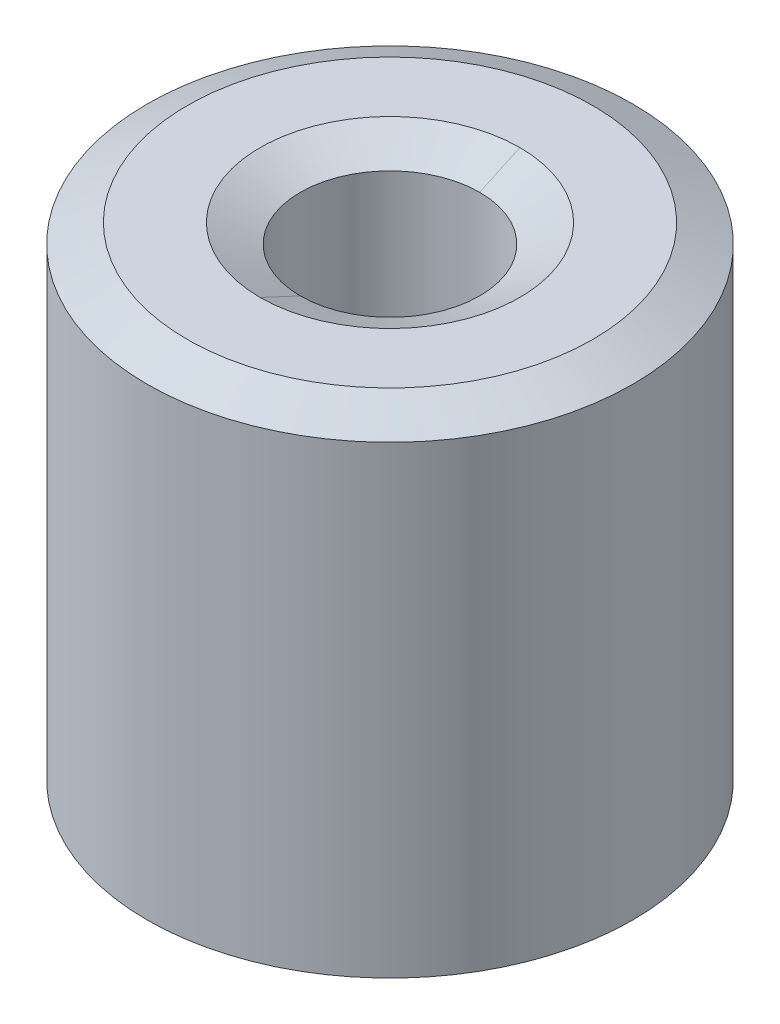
ISO-10303-21;
HEADER;
FILE_DESCRIPTION(('STEP AP214'),'2;1');
FILE_NAME('part.step','',(''),(''),'','','');
FILE_SCHEMA(('AUTOMOTIVE_DESIGN { 1 0 10303 214 1 1 1 1 }'));
ENDSEC;
DATA;
#1=APPLICATION_CONTEXT('core data for automotive mechanical design processes');
#2=APPLICATION_PROTOCOL_DEFINITION('international standard','automotive_design',2000,#1);
#3=PRODUCT_CONTEXT('',#1,'mechanical');
#4=PRODUCT('Part','Part','',(#3));
#5=PRODUCT_RELATED_PRODUCT_CATEGORY('part','',(#4));
#6=PRODUCT_DEFINITION_FORMATION('','',#4);
#7=PRODUCT_DEFINITION_CONTEXT('part definition',#1,'design');
#8=PRODUCT_DEFINITION('design','',#6,#7);
#9=PRODUCT_DEFINITION_SHAPE('','',#8);
#10=(LENGTH_UNIT() NAMED_UNIT(*) SI_UNIT(.MILLI.,.METRE.));
#11=(NAMED_UNIT(*) PLANE_ANGLE_UNIT() SI_UNIT($,.RADIAN.));
#12=(NAMED_UNIT(*) SI_UNIT($,.STERADIAN.) SOLID_ANGLE_UNIT());
#13=UNCERTAINTY_MEASURE_WITH_UNIT(LENGTH_MEASURE(1.E-05),#10,'distance_accuracy_value','');
#14=(GEOMETRIC_REPRESENTATION_CONTEXT(3) GLOBAL_UNCERTAINTY_ASSIGNED_CONTEXT((#13)) GLOBAL_UNIT_ASSIGNED_CONTEXT((#10,
#11,#12)) REPRESENTATION_CONTEXT('',''));
#15=CARTESIAN_POINT('',(0.,0.,0.));
#16=DIRECTION('',(0.,0.,1.));
#17=DIRECTION('',(1.,0.,0.));
#18=AXIS2_PLACEMENT_3D('',#15,#16,#17);
#19=CARTESIAN_POINT('',(7.9,5.692500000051,-34.0999230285));
#20=DIRECTION('',(0.,1.,0.));
#21=DIRECTION('',(0.,0.,1.));
#22=AXIS2_PLACEMENT_3D('',#19,#20,#21);
#23=CYLINDRICAL_SURFACE('',#22,0.85);
#24=CARTESIAN_POINT('',(7.9,2.83469691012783,-34.0999230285));
#25=DIRECTION('',(0.,-1.,0.));
#26=DIRECTION('',(-1.,0.,0.));
#27=AXIS2_PLACEMENT_3D('',#24,#25,#26);
#28=CIRCLE('',#27,0.850000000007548);
#29=CARTESIAN_POINT('',(7.04999999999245,2.83469691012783,-34.0999230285));
#30=VERTEX_POINT('',#29);
#31=EDGE_CURVE('E51',#30,#30,#28,.T.);
#32=ORIENTED_EDGE('',*,*,#31,.T.);
#33=EDGE_LOOP('',(#32));
#34=FACE_BOUND('',#33,.T.);
#35=CARTESIAN_POINT('',(7.9,7.23030308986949,-34.0999230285));
#36=DIRECTION('',(0.,1.,0.));
#37=DIRECTION('',(1.,0.,0.));
#38=AXIS2_PLACEMENT_3D('',#35,#36,#37);
#39=CIRCLE('',#38,0.849999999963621);
#40=CARTESIAN_POINT('',(7.9000000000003,7.23030308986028,-34.9499230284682));
#41=VERTEX_POINT('',#40);
#42=CARTESIAN_POINT('',(7.9,7.2303030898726,-33.2499230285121));
#43=VERTEX_POINT('',#42);
#44=EDGE_CURVE('E49',#41,#43,#39,.T.);
#45=ORIENTED_EDGE('',*,*,#44,.T.);
#46=CARTESIAN_POINT('',(7.90000000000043,7.230303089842,-34.0999230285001));
#47=DIRECTION('',(1.09266423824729E-12,1.,-1.60426662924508E-13));
#48=DIRECTION('',(1.,-1.09287578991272E-12,0.));
#49=AXIS2_PLACEMENT_3D('',#46,#47,#48);
#50=CIRCLE('',#49,0.849999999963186);
#51=EDGE_CURVE('E42',#43,#41,#50,.T.);
#52=ORIENTED_EDGE('',*,*,#51,.T.);
#53=EDGE_LOOP('',(#45,#52));
#54=FACE_BOUND('',#53,.T.);
#55=ADVANCED_FACE('F16',(#34,#54),#23,.F.);
#56=CARTESIAN_POINT('',(7.90000000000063,7.40749999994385,-34.0999230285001));
#57=DIRECTION('',(1.09301682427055E-12,1.,-1.60779248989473E-13));
#58=DIRECTION('',(-1.,1.09301682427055E-12,0.));
#59=AXIS2_PLACEMENT_3D('',#56,#57,#58);
#60=CONICAL_SURFACE('',#59,1.23000000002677,1.13446401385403);
#61=CARTESIAN_POINT('',(7.9,7.23030308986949,-33.2499230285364));
#62=CARTESIAN_POINT('',(7.90000000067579,7.2376862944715,-33.2340896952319));
#63=CARTESIAN_POINT('',(7.90000000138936,7.24506949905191,-33.2182563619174));
#64=CARTESIAN_POINT('',(7.90000000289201,7.25983590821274,-33.1865896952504));
#65=CARTESIAN_POINT('',(7.9000000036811,7.26721911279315,-33.170756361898));
#66=CARTESIAN_POINT('',(7.90000000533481,7.28198552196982,-33.1390896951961));
#67=CARTESIAN_POINT('',(7.90000000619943,7.28936872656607,-33.1232563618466));
#68=CARTESIAN_POINT('',(7.90000000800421,7.304135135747,-33.0915896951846));
#69=CARTESIAN_POINT('',(7.90000000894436,7.31151834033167,-33.0757563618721));
#70=CARTESIAN_POINT('',(7.90000001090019,7.3262847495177,-33.0440896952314));
#71=CARTESIAN_POINT('',(7.90000001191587,7.33366795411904,-33.0282563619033));
#72=CARTESIAN_POINT('',(7.90000001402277,7.34843436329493,-32.99658969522));
#73=CARTESIAN_POINT('',(7.90000001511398,7.35581756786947,-32.9807563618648));
#74=CARTESIAN_POINT('',(7.90000001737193,7.37058397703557,-32.9490896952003));
#75=CARTESIAN_POINT('',(7.90000001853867,7.37796718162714,-32.933256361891));
#76=CARTESIAN_POINT('',(7.90000002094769,7.39273359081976,-32.9015896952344));
#77=CARTESIAN_POINT('',(7.90000002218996,7.40011679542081,-32.8857563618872));
#78=CARTESIAN_POINT('',(7.90000002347,7.40749999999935,-32.8699230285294));
#79=B_SPLINE_CURVE_WITH_KNOTS('',3,(#61,#62,#63,#64,#65,#66,#67,#68,#69,#70,#71,#72,#73,#74,#75,
#76,#77,#78),.UNSPECIFIED.,.F.,.F.,(4,2,2,2,2,2,2,2,4),(0.,0.0524104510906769,0.104820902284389,
0.157231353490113,0.20964180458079,0.262052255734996,0.314462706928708,0.366873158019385,
0.419283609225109),.UNSPECIFIED.);
#80=CARTESIAN_POINT('',(7.90000002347,7.40749999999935,-32.8699230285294));
#81=VERTEX_POINT('',#80);
#82=EDGE_CURVE('E36',#43,#81,#79,.T.);
#83=ORIENTED_EDGE('',*,*,#82,.T.);
#84=CARTESIAN_POINT('',(7.90000000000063,7.40749999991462,-34.0999230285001));
#85=DIRECTION('',(1.09301682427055E-12,1.,-1.60779248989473E-13));
#86=DIRECTION('',(-1.,1.09301682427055E-12,0.));
#87=AXIS2_PLACEMENT_3D('',#84,#85,#86);
#88=CIRCLE('',#87,1.22999999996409);
#89=CARTESIAN_POINT('',(7.90000000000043,7.40749999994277,-35.3299230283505));
#90=VERTEX_POINT('',#89);
#91=EDGE_CURVE('E19',#81,#90,#88,.T.);
#92=ORIENTED_EDGE('',*,*,#91,.T.);
#93=DIRECTION('',(-3.19625813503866E-13,-0.422618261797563,0.906307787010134));
#94=VECTOR('',#93,1.);
#95=CARTESIAN_POINT('',(7.90000017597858,232690.67156854,-499026.199923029));
#96=LINE('',#95,#94);
#97=EDGE_CURVE('E45',#90,#41,#96,.T.);
#98=ORIENTED_EDGE('',*,*,#97,.T.);
#99=ORIENTED_EDGE('',*,*,#51,.F.);
#100=EDGE_LOOP('',(#83,#92,#98,#99));
#101=FACE_BOUND('',#100,.T.);
#102=ADVANCED_FACE('F44',(#101),#60,.F.);
#103=CARTESIAN_POINT('',(7.9,7.40749999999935,-34.0999230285));
#104=DIRECTION('',(0.,1.,0.));
#105=DIRECTION('',(0.,0.,1.));
#106=AXIS2_PLACEMENT_3D('',#103,#104,#105);
#107=CONICAL_SURFACE('',#106,1.22999999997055,1.1344640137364);
#108=ORIENTED_EDGE('',*,*,#97,.F.);
#109=CARTESIAN_POINT('',(7.9,7.40749999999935,-34.0999230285));
#110=DIRECTION('',(0.,1.,0.));
#111=DIRECTION('',(0.,0.,1.));
#112=AXIS2_PLACEMENT_3D('',#109,#110,#111);
#113=CIRCLE('',#112,1.22999999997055);
#114=EDGE_CURVE('E55',#90,#81,#113,.T.);
#115=ORIENTED_EDGE('',*,*,#114,.T.);
#116=ORIENTED_EDGE('',*,*,#82,.F.);
#117=ORIENTED_EDGE('',*,*,#44,.F.);
#118=EDGE_LOOP('',(#108,#115,#116,#117));
#119=FACE_BOUND('',#118,.T.);
#120=ADVANCED_FACE('F53',(#119),#107,.F.);
#121=CARTESIAN_POINT('',(7.9,2.65749999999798,-34.0999230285));
#122=DIRECTION('',(0.,-1.,0.));
#123=DIRECTION('',(0.,0.,-1.));
#124=AXIS2_PLACEMENT_3D('',#121,#122,#123);
#125=CONICAL_SURFACE('',#124,1.22999999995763,1.1344640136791);
#126=ORIENTED_EDGE('',*,*,#31,.F.);
#127=EDGE_LOOP('',(#126));
#128=FACE_BOUND('',#127,.T.);
#129=CARTESIAN_POINT('',(7.9,2.65749999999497,-34.0999230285));
#130=DIRECTION('',(0.,-1.,0.));
#131=DIRECTION('',(0.,0.,-1.));
#132=AXIS2_PLACEMENT_3D('',#129,#130,#131);
#133=CIRCLE('',#132,1.22999999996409);
#134=CARTESIAN_POINT('',(7.9,2.65749999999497,-35.3299230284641));
#135=VERTEX_POINT('',#134);
#136=EDGE_CURVE('E115',#135,#135,#133,.F.);
#137=ORIENTED_EDGE('',*,*,#136,.F.);
#138=EDGE_LOOP('',(#137));
#139=FACE_BOUND('',#138,.T.);
#140=ADVANCED_FACE('F74',(#128,#139),#125,.F.);
#141=CARTESIAN_POINT('',(3.8,7.4075,-8.1));
#142=DIRECTION('',(0.,-1.,0.));
#143=DIRECTION('',(0.,0.,-1.));
#144=AXIS2_PLACEMENT_3D('',#141,#142,#143);
#145=PLANE('',#144);
#146=ORIENTED_EDGE('',*,*,#91,.F.);
#147=ORIENTED_EDGE('',*,*,#114,.F.);
#148=EDGE_LOOP('',(#146,#147));
#149=FACE_BOUND('',#148,.T.);
#150=CARTESIAN_POINT('',(7.90000000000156,7.40750000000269,-34.1000000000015));
#151=DIRECTION('',(1.74452843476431E-12,-1.,-1.70436581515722E-12));
#152=DIRECTION('',(1.,1.74452843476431E-12,0.));
#153=AXIS2_PLACEMENT_3D('',#150,#151,#152);
#154=CIRCLE('',#153,1.92000000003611);
#155=CARTESIAN_POINT('',(9.82000000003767,7.40750000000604,-34.1000000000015));
#156=VERTEX_POINT('',#155);
#157=EDGE_CURVE('E113',#156,#156,#154,.T.);
#158=ORIENTED_EDGE('',*,*,#157,.F.);
#159=EDGE_LOOP('',(#158));
#160=FACE_BOUND('',#159,.T.);
#161=ADVANCED_FACE('F102',(#149,#160),#145,.F.);
#162=CARTESIAN_POINT('',(3.8,2.6575,-8.1));
#163=DIRECTION('',(0.,-1.,0.));
#164=DIRECTION('',(0.,0.,-1.));
#165=AXIS2_PLACEMENT_3D('',#162,#163,#164);
#166=PLANE('',#165);
#167=ORIENTED_EDGE('',*,*,#136,.T.);
#168=EDGE_LOOP('',(#167));
#169=FACE_BOUND('',#168,.T.);
#170=CARTESIAN_POINT('',(7.90000000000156,2.65750000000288,-34.1000000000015));
#171=DIRECTION('',(1.74424559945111E-12,1.,-1.70427153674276E-12));
#172=DIRECTION('',(-1.,1.74424559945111E-12,0.));
#173=AXIS2_PLACEMENT_3D('',#170,#171,#172);
#174=CIRCLE('',#173,1.91999999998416);
#175=CARTESIAN_POINT('',(5.98000000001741,2.65750000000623,-34.1000000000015));
#176=VERTEX_POINT('',#175);
#177=EDGE_CURVE('E114',#176,#176,#174,.T.);
#178=ORIENTED_EDGE('',*,*,#177,.F.);
#179=EDGE_LOOP('',(#178));
#180=FACE_BOUND('',#179,.T.);
#181=ADVANCED_FACE('F99',(#169,#180),#166,.T.);
#182=CARTESIAN_POINT('',(7.90000000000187,7.23030308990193,-34.1000000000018));
#183=DIRECTION('',(1.74452843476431E-12,-1.,-1.70436581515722E-12));
#184=DIRECTION('',(1.,1.74452843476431E-12,0.));
#185=AXIS2_PLACEMENT_3D('',#182,#183,#184);
#186=CONICAL_SURFACE('',#185,2.2999999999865,1.13446401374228);
#187=ORIENTED_EDGE('',*,*,#157,.T.);
#188=EDGE_LOOP('',(#187));
#189=FACE_BOUND('',#188,.T.);
#190=CARTESIAN_POINT('',(7.9,7.2303030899,-34.1));
#191=DIRECTION('',(0.,1.,0.));
#192=DIRECTION('',(0.,0.,1.));
#193=AXIS2_PLACEMENT_3D('',#190,#191,#192);
#194=CIRCLE('',#193,2.3);
#195=CARTESIAN_POINT('',(7.9,7.2303030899,-31.8));
#196=VERTEX_POINT('',#195);
#197=EDGE_CURVE('E24',#196,#196,#194,.F.);
#198=ORIENTED_EDGE('',*,*,#197,.F.);
#199=EDGE_LOOP('',(#198));
#200=FACE_BOUND('',#199,.T.);
#201=ADVANCED_FACE('F91',(#189,#200),#186,.T.);
#202=CARTESIAN_POINT('',(7.90000000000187,2.83469691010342,-34.1000000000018));
#203=DIRECTION('',(1.74424559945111E-12,1.,-1.70427153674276E-12));
#204=DIRECTION('',(-1.,1.74424559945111E-12,0.));
#205=AXIS2_PLACEMENT_3D('',#202,#203,#204);
#206=CONICAL_SURFACE('',#205,2.29999999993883,1.13446401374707);
#207=CARTESIAN_POINT('',(7.9,2.8346969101,-34.1));
#208=DIRECTION('',(0.,1.,0.));
#209=DIRECTION('',(0.,0.,1.));
#210=AXIS2_PLACEMENT_3D('',#207,#208,#209);
#211=CIRCLE('',#210,2.3);
#212=CARTESIAN_POINT('',(7.9,2.8346969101,-31.8));
#213=VERTEX_POINT('',#212);
#214=EDGE_CURVE('E11',#213,#213,#211,.T.);
#215=ORIENTED_EDGE('',*,*,#214,.F.);
#216=EDGE_LOOP('',(#215));
#217=FACE_BOUND('',#216,.T.);
#218=ORIENTED_EDGE('',*,*,#177,.T.);
#219=EDGE_LOOP('',(#218));
#220=FACE_BOUND('',#219,.T.);
#221=ADVANCED_FACE('F85',(#217,#220),#206,.T.);
#222=CARTESIAN_POINT('',(7.9,5.0325,-34.1));
#223=DIRECTION('',(0.,1.,0.));
#224=DIRECTION('',(0.,0.,1.));
#225=AXIS2_PLACEMENT_3D('',#222,#223,#224);
#226=CYLINDRICAL_SURFACE('',#225,2.3);
#227=ORIENTED_EDGE('',*,*,#197,.T.);
#228=EDGE_LOOP('',(#227));
#229=FACE_BOUND('',#228,.T.);
#230=ORIENTED_EDGE('',*,*,#214,.T.);
#231=EDGE_LOOP('',(#230));
#232=FACE_BOUND('',#231,.T.);
#233=ADVANCED_FACE('F83',(#229,#232),#226,.T.);
#234=CLOSED_SHELL('',(#55,#102,#120,#140,#161,#181,#201,#221,#233));
#235=MANIFOLD_SOLID_BREP('B1',#234);
#236=ADVANCED_BREP_SHAPE_REPRESENTATION('',(#18,#235),#14);
#237=SHAPE_DEFINITION_REPRESENTATION(#9,#236);
ENDSEC;
END-ISO-10303-21;
